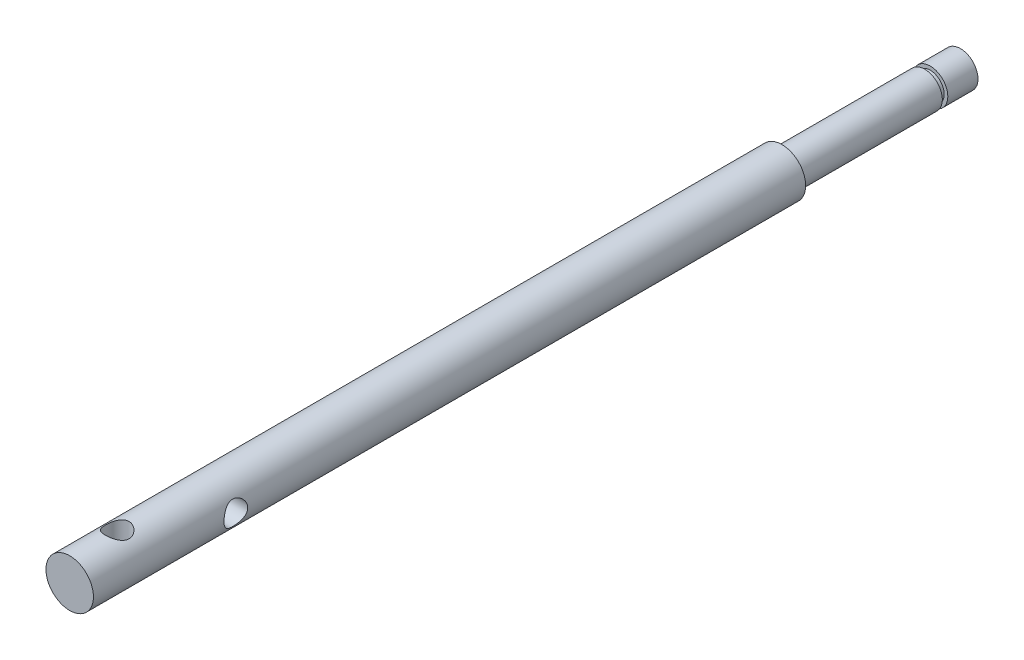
from build123d import *

# Parameters (mm, degrees)
SKETCH1_R          = 2.3495
BASE_EXTRUDE_DEPTH = 23.876
SKETCH12_W         = 0.7366
SKETCH12_H         = 0.814062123
SKETCH13_R         = 3.175
SHANK_DEPTH        = 95.25
SKETCH14_R         = 1.5875
CUT_EXTRUDE1_DEPTH = 3.81
SKETCH15_R         = 1.5875
CUT_EXTRUDE2_DEPTH = 3.81


with BuildPart() as part:
    # Sketch1 → Base-Extrude (new body)
    with BuildSketch(Plane.XY):
        Circle(SKETCH1_R)
    extrude(amount=BASE_EXTRUDE_DEPTH)

    # Sketch12 → SnapRingGroove (revolve, cut)
    with BuildSketch(Plane(origin=(0, 0, 0), x_dir=(0, 0, -1), z_dir=(1, 0, 0)), mode=Mode.PRIVATE) as snapringgroove_sk:
        with Locations((-4.4069, 2.273931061)):
            Rectangle(SKETCH12_W, SKETCH12_H)
    revolve(snapringgroove_sk.sketch.rotate(Axis((0, 0, 0), (0, 0, 1)), 90), axis=Axis((0, 0, 0), (0, 0, 1)), mode=Mode.SUBTRACT)

    # Sketch13 → Shank (add)
    with BuildSketch(Plane.XY.offset(23.876)):
        Circle(SKETCH13_R)
    extrude(amount=SHANK_DEPTH)

    # Sketch14 → Cut-Extrude1 (cut, symmetric)
    with BuildSketch(Plane(origin=(0, 0, 0), x_dir=(1, 0, 0), z_dir=(0, 1, 0))):
        with Locations(Location((0, -112.776, 0), (0, 0, 270))):
            Circle(SKETCH14_R)
    extrude(amount=CUT_EXTRUDE1_DEPTH, both=True, mode=Mode.SUBTRACT)

    # Sketch15 → Cut-Extrude2 (cut, symmetric)
    with BuildSketch(Plane(origin=(0, 0, 0), x_dir=(0, 0, -1), z_dir=(1, 0, 0))):
        with Locations(Location((-100.076, 0, 0), (0, 0, 179.999999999))):
            Circle(SKETCH15_R)
    extrude(amount=CUT_EXTRUDE2_DEPTH, both=True, mode=Mode.SUBTRACT)


solid = part.part
